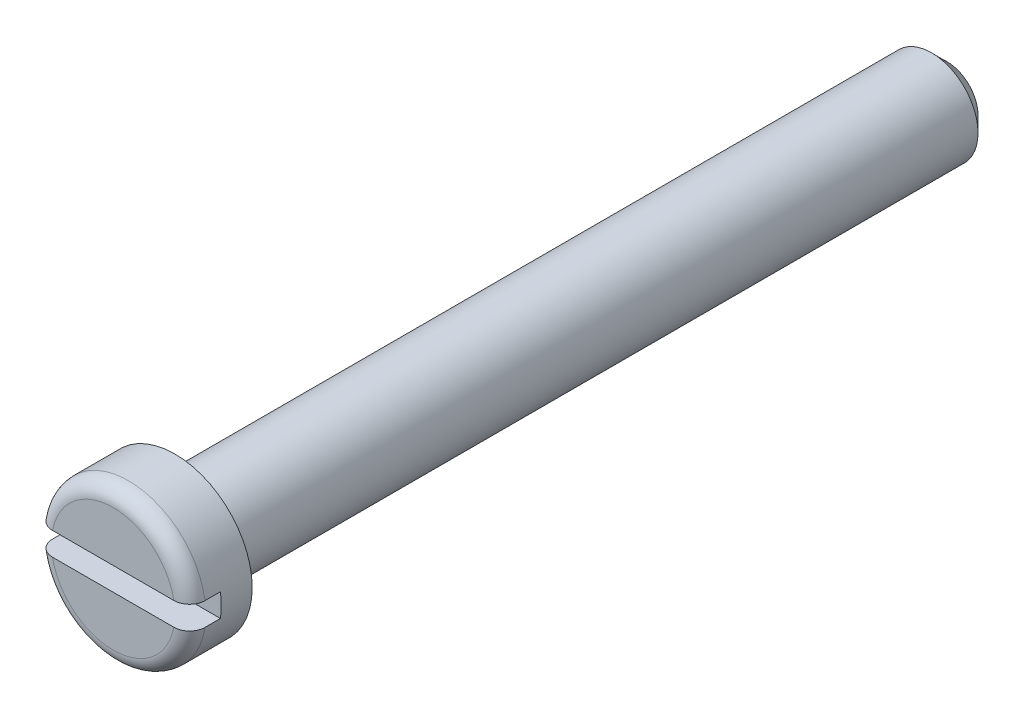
ISO-10303-21;
HEADER;
FILE_DESCRIPTION(('STEP AP214'),'2;1');
FILE_NAME('part.step','',(''),(''),'','','');
FILE_SCHEMA(('AUTOMOTIVE_DESIGN { 1 0 10303 214 1 1 1 1 }'));
ENDSEC;
DATA;
#1=APPLICATION_CONTEXT('core data for automotive mechanical design processes');
#2=APPLICATION_PROTOCOL_DEFINITION('international standard','automotive_design',2000,#1);
#3=PRODUCT_CONTEXT('',#1,'mechanical');
#4=PRODUCT('Part','Part','',(#3));
#5=PRODUCT_RELATED_PRODUCT_CATEGORY('part','',(#4));
#6=PRODUCT_DEFINITION_FORMATION('','',#4);
#7=PRODUCT_DEFINITION_CONTEXT('part definition',#1,'design');
#8=PRODUCT_DEFINITION('design','',#6,#7);
#9=PRODUCT_DEFINITION_SHAPE('','',#8);
#10=(LENGTH_UNIT() NAMED_UNIT(*) SI_UNIT(.MILLI.,.METRE.));
#11=(NAMED_UNIT(*) PLANE_ANGLE_UNIT() SI_UNIT($,.RADIAN.));
#12=(NAMED_UNIT(*) SI_UNIT($,.STERADIAN.) SOLID_ANGLE_UNIT());
#13=UNCERTAINTY_MEASURE_WITH_UNIT(LENGTH_MEASURE(1.E-05),#10,'distance_accuracy_value','');
#14=(GEOMETRIC_REPRESENTATION_CONTEXT(3) GLOBAL_UNCERTAINTY_ASSIGNED_CONTEXT((#13)) GLOBAL_UNIT_ASSIGNED_CONTEXT((#10,
#11,#12)) REPRESENTATION_CONTEXT('',''));
#15=CARTESIAN_POINT('',(0.,0.,0.));
#16=DIRECTION('',(0.,0.,1.));
#17=DIRECTION('',(1.,0.,0.));
#18=AXIS2_PLACEMENT_3D('',#15,#16,#17);
#19=CARTESIAN_POINT('',(0.,0.,54.));
#20=DIRECTION('',(0.,0.,1.));
#21=DIRECTION('',(1.,0.,0.));
#22=AXIS2_PLACEMENT_3D('',#19,#20,#21);
#23=PLANE('',#22);
#24=DIRECTION('',(-1.,0.,0.));
#25=VECTOR('',#24,1.);
#26=CARTESIAN_POINT('',(0.,0.75,54.));
#27=LINE('',#26,#25);
#28=CARTESIAN_POINT('',(3.92905841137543,0.75,54.));
#29=VERTEX_POINT('',#28);
#30=CARTESIAN_POINT('',(-3.92905841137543,0.75,54.));
#31=VERTEX_POINT('',#30);
#32=EDGE_CURVE('E131',#29,#31,#27,.T.);
#33=ORIENTED_EDGE('',*,*,#32,.F.);
#34=CARTESIAN_POINT('',(0.,0.,54.));
#35=DIRECTION('',(0.,0.,1.));
#36=DIRECTION('',(1.,0.,0.));
#37=AXIS2_PLACEMENT_3D('',#34,#35,#36);
#38=CIRCLE('',#37,4.);
#39=EDGE_CURVE('E180',#29,#31,#38,.T.);
#40=ORIENTED_EDGE('',*,*,#39,.T.);
#41=EDGE_LOOP('',(#33,#40));
#42=FACE_BOUND('',#41,.T.);
#43=ADVANCED_FACE('F31',(#42),#23,.T.);
#44=CARTESIAN_POINT('',(0.,0.,50.));
#45=DIRECTION('',(0.,0.,-1.));
#46=DIRECTION('',(-1.,0.,0.));
#47=AXIS2_PLACEMENT_3D('',#44,#45,#46);
#48=CYLINDRICAL_SURFACE('',#47,3.);
#49=CARTESIAN_POINT('',(0.,0.,1.00000000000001));
#50=DIRECTION('',(0.,0.,1.));
#51=DIRECTION('',(1.,0.,0.));
#52=AXIS2_PLACEMENT_3D('',#49,#50,#51);
#53=CIRCLE('',#52,3.);
#54=CARTESIAN_POINT('',(3.,0.,1.00000000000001));
#55=VERTEX_POINT('',#54);
#56=EDGE_CURVE('E39',#55,#55,#53,.T.);
#57=ORIENTED_EDGE('',*,*,#56,.T.);
#58=EDGE_LOOP('',(#57));
#59=FACE_BOUND('',#58,.T.);
#60=CARTESIAN_POINT('',(0.,0.,50.));
#61=DIRECTION('',(0.,0.,1.));
#62=DIRECTION('',(1.,0.,0.));
#63=AXIS2_PLACEMENT_3D('',#60,#61,#62);
#64=CIRCLE('',#63,3.);
#65=CARTESIAN_POINT('',(3.,0.,50.));
#66=VERTEX_POINT('',#65);
#67=EDGE_CURVE('E126',#66,#66,#64,.T.);
#68=ORIENTED_EDGE('',*,*,#67,.F.);
#69=EDGE_LOOP('',(#68));
#70=FACE_BOUND('',#69,.T.);
#71=ADVANCED_FACE('F33',(#59,#70),#48,.T.);
#72=CARTESIAN_POINT('',(0.,0.,0.));
#73=DIRECTION('',(0.,0.,1.));
#74=DIRECTION('',(1.,0.,0.));
#75=AXIS2_PLACEMENT_3D('',#72,#73,#74);
#76=PLANE('',#75);
#77=CARTESIAN_POINT('',(0.,0.,0.));
#78=DIRECTION('',(0.,0.,1.));
#79=DIRECTION('',(1.,0.,0.));
#80=AXIS2_PLACEMENT_3D('',#77,#78,#79);
#81=CIRCLE('',#80,1.99999999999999);
#82=CARTESIAN_POINT('',(1.99999999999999,0.,0.));
#83=VERTEX_POINT('',#82);
#84=EDGE_CURVE('E11',#83,#83,#81,.F.);
#85=ORIENTED_EDGE('',*,*,#84,.T.);
#86=EDGE_LOOP('',(#85));
#87=FACE_BOUND('',#86,.T.);
#88=ADVANCED_FACE('F161',(#87),#76,.F.);
#89=CARTESIAN_POINT('',(0.,0.,50.));
#90=DIRECTION('',(0.,0.,1.));
#91=DIRECTION('',(1.,0.,0.));
#92=AXIS2_PLACEMENT_3D('',#89,#90,#91);
#93=PLANE('',#92);
#94=CARTESIAN_POINT('',(0.,0.,50.));
#95=DIRECTION('',(0.,0.,1.));
#96=DIRECTION('',(1.,0.,0.));
#97=AXIS2_PLACEMENT_3D('',#94,#95,#96);
#98=CIRCLE('',#97,5.);
#99=CARTESIAN_POINT('',(5.,0.,50.));
#100=VERTEX_POINT('',#99);
#101=EDGE_CURVE('E123',#100,#100,#98,.T.);
#102=ORIENTED_EDGE('',*,*,#101,.F.);
#103=EDGE_LOOP('',(#102));
#104=FACE_BOUND('',#103,.T.);
#105=ORIENTED_EDGE('',*,*,#67,.T.);
#106=EDGE_LOOP('',(#105));
#107=FACE_BOUND('',#106,.T.);
#108=ADVANCED_FACE('F157',(#104,#107),#93,.F.);
#109=CARTESIAN_POINT('',(0.,0.,54.));
#110=DIRECTION('',(0.,0.,-1.));
#111=DIRECTION('',(-1.,0.,0.));
#112=AXIS2_PLACEMENT_3D('',#109,#110,#111);
#113=CYLINDRICAL_SURFACE('',#112,5.);
#114=DIRECTION('',(0.,0.,-1.));
#115=VECTOR('',#114,1.);
#116=CARTESIAN_POINT('',(4.9434299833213,-0.75,54.));
#117=LINE('',#116,#115);
#118=CARTESIAN_POINT('',(4.9434299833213,-0.75,52.));
#119=VERTEX_POINT('',#118);
#120=CARTESIAN_POINT('',(4.9434299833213,-0.75,53.));
#121=VERTEX_POINT('',#120);
#122=EDGE_CURVE('E100',#119,#121,#117,.F.);
#123=ORIENTED_EDGE('',*,*,#122,.T.);
#124=CARTESIAN_POINT('',(0.,0.,53.));
#125=DIRECTION('',(0.,0.,1.));
#126=DIRECTION('',(1.,0.,0.));
#127=AXIS2_PLACEMENT_3D('',#124,#125,#126);
#128=CIRCLE('',#127,5.);
#129=CARTESIAN_POINT('',(-4.9434299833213,-0.75,53.));
#130=VERTEX_POINT('',#129);
#131=EDGE_CURVE('E95',#121,#130,#128,.F.);
#132=ORIENTED_EDGE('',*,*,#131,.T.);
#133=DIRECTION('',(0.,0.,-1.));
#134=VECTOR('',#133,1.);
#135=CARTESIAN_POINT('',(-4.9434299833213,-0.75,54.));
#136=LINE('',#135,#134);
#137=CARTESIAN_POINT('',(-4.9434299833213,-0.75,52.));
#138=VERTEX_POINT('',#137);
#139=EDGE_CURVE('E87',#130,#138,#136,.T.);
#140=ORIENTED_EDGE('',*,*,#139,.T.);
#141=CARTESIAN_POINT('',(0.,0.,52.));
#142=DIRECTION('',(0.,0.,1.));
#143=DIRECTION('',(1.,0.,0.));
#144=AXIS2_PLACEMENT_3D('',#141,#142,#143);
#145=CIRCLE('',#144,5.);
#146=CARTESIAN_POINT('',(-4.9434299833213,0.75,52.));
#147=VERTEX_POINT('',#146);
#148=EDGE_CURVE('E93',#147,#138,#145,.T.);
#149=ORIENTED_EDGE('',*,*,#148,.F.);
#150=DIRECTION('',(0.,0.,-1.));
#151=VECTOR('',#150,1.);
#152=CARTESIAN_POINT('',(-4.9434299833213,0.75,54.));
#153=LINE('',#152,#151);
#154=CARTESIAN_POINT('',(-4.9434299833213,0.75,53.));
#155=VERTEX_POINT('',#154);
#156=EDGE_CURVE('E99',#147,#155,#153,.F.);
#157=ORIENTED_EDGE('',*,*,#156,.T.);
#158=CARTESIAN_POINT('',(0.,0.,53.));
#159=DIRECTION('',(0.,0.,1.));
#160=DIRECTION('',(1.,0.,0.));
#161=AXIS2_PLACEMENT_3D('',#158,#159,#160);
#162=CIRCLE('',#161,5.);
#163=CARTESIAN_POINT('',(4.9434299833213,0.75,53.));
#164=VERTEX_POINT('',#163);
#165=EDGE_CURVE('E184',#155,#164,#162,.F.);
#166=ORIENTED_EDGE('',*,*,#165,.T.);
#167=DIRECTION('',(0.,0.,-1.));
#168=VECTOR('',#167,1.);
#169=CARTESIAN_POINT('',(4.9434299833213,0.75,54.));
#170=LINE('',#169,#168);
#171=CARTESIAN_POINT('',(4.9434299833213,0.75,52.));
#172=VERTEX_POINT('',#171);
#173=EDGE_CURVE('E121',#164,#172,#170,.T.);
#174=ORIENTED_EDGE('',*,*,#173,.T.);
#175=EDGE_CURVE('E112',#119,#172,#145,.T.);
#176=ORIENTED_EDGE('',*,*,#175,.F.);
#177=EDGE_LOOP('',(#123,#132,#140,#149,#157,#166,#174,#176));
#178=FACE_BOUND('',#177,.T.);
#179=ORIENTED_EDGE('',*,*,#101,.T.);
#180=EDGE_LOOP('',(#179));
#181=FACE_BOUND('',#180,.T.);
#182=ADVANCED_FACE('F90',(#178,#181),#113,.T.);
#183=DIRECTION('',(1.,0.,0.));
#184=VECTOR('',#183,1.);
#185=CARTESIAN_POINT('',(0.,-0.75,54.));
#186=LINE('',#185,#184);
#187=CARTESIAN_POINT('',(-3.92905841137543,-0.75,54.));
#188=VERTEX_POINT('',#187);
#189=CARTESIAN_POINT('',(3.92905841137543,-0.75,54.));
#190=VERTEX_POINT('',#189);
#191=EDGE_CURVE('E129',#188,#190,#186,.T.);
#192=ORIENTED_EDGE('',*,*,#191,.F.);
#193=CARTESIAN_POINT('',(0.,0.,54.));
#194=DIRECTION('',(0.,0.,1.));
#195=DIRECTION('',(1.,0.,0.));
#196=AXIS2_PLACEMENT_3D('',#193,#194,#195);
#197=CIRCLE('',#196,4.);
#198=EDGE_CURVE('E111',#188,#190,#197,.T.);
#199=ORIENTED_EDGE('',*,*,#198,.T.);
#200=EDGE_LOOP('',(#192,#199));
#201=FACE_BOUND('',#200,.T.);
#202=ADVANCED_FACE('F163',(#201),#23,.T.);
#203=CARTESIAN_POINT('',(-5.69039913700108,-0.75,52.));
#204=DIRECTION('',(0.,0.,1.));
#205=DIRECTION('',(1.,0.,0.));
#206=AXIS2_PLACEMENT_3D('',#203,#204,#205);
#207=PLANE('',#206);
#208=ORIENTED_EDGE('',*,*,#148,.T.);
#209=DIRECTION('',(1.,0.,0.));
#210=VECTOR('',#209,1.);
#211=CARTESIAN_POINT('',(-5.69039913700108,-0.75,52.));
#212=LINE('',#211,#210);
#213=EDGE_CURVE('E107',#138,#119,#212,.T.);
#214=ORIENTED_EDGE('',*,*,#213,.T.);
#215=ORIENTED_EDGE('',*,*,#175,.T.);
#216=DIRECTION('',(-1.,0.,0.));
#217=VECTOR('',#216,1.);
#218=CARTESIAN_POINT('',(-5.69039913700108,0.75,52.));
#219=LINE('',#218,#217);
#220=EDGE_CURVE('E110',#172,#147,#219,.T.);
#221=ORIENTED_EDGE('',*,*,#220,.T.);
#222=EDGE_LOOP('',(#208,#214,#215,#221));
#223=FACE_BOUND('',#222,.T.);
#224=ADVANCED_FACE('F105',(#223),#207,.T.);
#225=CARTESIAN_POINT('',(-5.69039913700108,0.75,52.));
#226=DIRECTION('',(0.,1.,0.));
#227=DIRECTION('',(0.,0.,1.));
#228=AXIS2_PLACEMENT_3D('',#225,#226,#227);
#229=PLANE('',#228);
#230=ORIENTED_EDGE('',*,*,#32,.T.);
#231=CARTESIAN_POINT('',(-3.92905841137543,0.75,54.));
#232=CARTESIAN_POINT('',(-3.9579374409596,0.75,53.9999996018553));
#233=CARTESIAN_POINT('',(-3.9868031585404,0.75,53.9987922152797));
#234=CARTESIAN_POINT('',(-4.04433298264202,0.75,53.9939683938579));
#235=CARTESIAN_POINT('',(-4.07299708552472,0.75,53.990351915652));
#236=CARTESIAN_POINT('',(-4.15836171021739,0.75,53.9759066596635));
#237=CARTESIAN_POINT('',(-4.21449737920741,0.75,53.9614820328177));
#238=CARTESIAN_POINT('',(-4.32355636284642,0.75,53.92337495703));
#239=CARTESIAN_POINT('',(-4.37647706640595,0.75,53.8996850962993));
#240=CARTESIAN_POINT('',(-4.47752041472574,0.75,53.8436698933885));
#241=CARTESIAN_POINT('',(-4.52564486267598,0.75,53.8113478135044));
#242=CARTESIAN_POINT('',(-4.61518833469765,0.75,53.7393309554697));
#243=CARTESIAN_POINT('',(-4.65667217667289,0.75,53.6997167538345));
#244=CARTESIAN_POINT('',(-4.73229879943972,0.75,53.6139891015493));
#245=CARTESIAN_POINT('',(-4.76644022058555,0.75,53.5678744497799));
#246=CARTESIAN_POINT('',(-4.82592085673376,0.75,53.4711378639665));
#247=CARTESIAN_POINT('',(-4.85137165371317,0.75,53.4205844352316));
#248=CARTESIAN_POINT('',(-4.89331370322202,0.75,53.3159069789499));
#249=CARTESIAN_POINT('',(-4.90981179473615,0.75,53.2617857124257));
#250=CARTESIAN_POINT('',(-4.92884830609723,0.75,53.1727242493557));
#251=CARTESIAN_POINT('',(-4.93431353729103,0.75,53.1383825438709));
#252=CARTESIAN_POINT('',(-4.94160338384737,0.75,53.0693657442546));
#253=CARTESIAN_POINT('',(-4.94343330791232,0.75,53.0346912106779));
#254=CARTESIAN_POINT('',(-4.9434299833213,0.75,53.));
#255=B_SPLINE_CURVE_WITH_KNOTS('',3,(#231,#232,#233,#234,#235,#236,#237,#238,#239,#240,#241,
#242,#243,#244,#245,#246,#247,#248,#249,#250,#251,#252,#253,#254),.UNSPECIFIED.,.F.,.F.,(4,2,2,
2,2,2,2,2,2,2,2,4),(0.,0.0865850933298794,0.173171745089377,0.34615892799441,0.519284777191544,
0.692345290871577,0.863597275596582,1.03488094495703,1.20387456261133,1.37273890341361,
1.47688391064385,1.58087672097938),.UNSPECIFIED.);
#256=EDGE_CURVE('E46',#31,#155,#255,.T.);
#257=ORIENTED_EDGE('',*,*,#256,.T.);
#258=ORIENTED_EDGE('',*,*,#156,.F.);
#259=ORIENTED_EDGE('',*,*,#220,.F.);
#260=ORIENTED_EDGE('',*,*,#173,.F.);
#261=CARTESIAN_POINT('',(4.9434299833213,0.75,53.));
#262=CARTESIAN_POINT('',(4.94342993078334,0.75,53.0278892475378));
#263=CARTESIAN_POINT('',(4.94224916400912,0.75,53.0557650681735));
#264=CARTESIAN_POINT('',(4.93753952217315,0.75,53.1113157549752));
#265=CARTESIAN_POINT('',(4.93401080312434,0.75,53.1389906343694));
#266=CARTESIAN_POINT('',(4.91994054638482,0.75,53.2213524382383));
#267=CARTESIAN_POINT('',(4.90591478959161,0.75,53.2754852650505));
#268=CARTESIAN_POINT('',(4.86898224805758,0.75,53.380622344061));
#269=CARTESIAN_POINT('',(4.8460720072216,0.75,53.4316253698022));
#270=CARTESIAN_POINT('',(4.79205064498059,0.75,53.5290847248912));
#271=CARTESIAN_POINT('',(4.76094033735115,0.75,53.5755415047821));
#272=CARTESIAN_POINT('',(4.69127910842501,0.75,53.6628173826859));
#273=CARTESIAN_POINT('',(4.65269680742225,0.75,53.7036114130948));
#274=CARTESIAN_POINT('',(4.56928961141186,0.75,53.7782335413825));
#275=CARTESIAN_POINT('',(4.52446353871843,0.75,53.8120603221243));
#276=CARTESIAN_POINT('',(4.42933099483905,0.75,53.8721863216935));
#277=CARTESIAN_POINT('',(4.378969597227,0.75,53.8983985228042));
#278=CARTESIAN_POINT('',(4.27460791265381,0.75,53.942119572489));
#279=CARTESIAN_POINT('',(4.22060881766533,0.75,53.9596312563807));
#280=CARTESIAN_POINT('',(4.12681781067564,0.75,53.9817049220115));
#281=CARTESIAN_POINT('',(4.0875499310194,0.75,53.9885654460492));
#282=CARTESIAN_POINT('',(4.0085449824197,0.75,53.9977127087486));
#283=CARTESIAN_POINT('',(3.96880871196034,0.75,54.0000063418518));
#284=CARTESIAN_POINT('',(3.92905841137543,0.75,54.));
#285=B_SPLINE_CURVE_WITH_KNOTS('',3,(#261,#262,#263,#264,#265,#266,#267,#268,#269,#270,#271,
#272,#273,#274,#275,#276,#277,#278,#279,#280,#281,#282,#283,#284),.UNSPECIFIED.,.F.,.F.,(4,2,2,
2,2,2,2,2,2,2,2,4),(0.,0.0836161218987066,0.167226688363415,0.334125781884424,0.501089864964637,
0.668037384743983,0.835701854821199,1.0033979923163,1.17294125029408,1.34242922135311,
1.46176618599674,1.58092285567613),.UNSPECIFIED.);
#286=EDGE_CURVE('E54',#164,#29,#285,.T.);
#287=ORIENTED_EDGE('',*,*,#286,.T.);
#288=EDGE_LOOP('',(#230,#257,#258,#259,#260,#287));
#289=FACE_BOUND('',#288,.T.);
#290=ADVANCED_FACE('F155',(#289),#229,.F.);
#291=CARTESIAN_POINT('',(-5.69039913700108,-0.75,52.));
#292=DIRECTION('',(0.,-1.,0.));
#293=DIRECTION('',(0.,0.,-1.));
#294=AXIS2_PLACEMENT_3D('',#291,#292,#293);
#295=PLANE('',#294);
#296=ORIENTED_EDGE('',*,*,#191,.T.);
#297=CARTESIAN_POINT('',(3.92905841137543,-0.75,54.));
#298=CARTESIAN_POINT('',(3.9579374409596,-0.75,53.9999996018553));
#299=CARTESIAN_POINT('',(3.9868031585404,-0.75,53.9987922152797));
#300=CARTESIAN_POINT('',(4.04433298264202,-0.75,53.9939683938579));
#301=CARTESIAN_POINT('',(4.07299708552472,-0.75,53.990351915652));
#302=CARTESIAN_POINT('',(4.15836171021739,-0.75,53.9759066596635));
#303=CARTESIAN_POINT('',(4.21449737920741,-0.75,53.9614820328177));
#304=CARTESIAN_POINT('',(4.32355636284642,-0.75,53.92337495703));
#305=CARTESIAN_POINT('',(4.37647706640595,-0.75,53.8996850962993));
#306=CARTESIAN_POINT('',(4.47752041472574,-0.75,53.8436698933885));
#307=CARTESIAN_POINT('',(4.52564486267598,-0.75,53.8113478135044));
#308=CARTESIAN_POINT('',(4.61518833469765,-0.75,53.7393309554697));
#309=CARTESIAN_POINT('',(4.65667217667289,-0.75,53.6997167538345));
#310=CARTESIAN_POINT('',(4.73229879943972,-0.75,53.6139891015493));
#311=CARTESIAN_POINT('',(4.76644022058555,-0.75,53.5678744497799));
#312=CARTESIAN_POINT('',(4.82592085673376,-0.75,53.4711378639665));
#313=CARTESIAN_POINT('',(4.85137165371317,-0.75,53.4205844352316));
#314=CARTESIAN_POINT('',(4.89331370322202,-0.75,53.3159069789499));
#315=CARTESIAN_POINT('',(4.90981179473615,-0.75,53.2617857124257));
#316=CARTESIAN_POINT('',(4.92884830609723,-0.75,53.1727242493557));
#317=CARTESIAN_POINT('',(4.93431353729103,-0.75,53.1383825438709));
#318=CARTESIAN_POINT('',(4.94160338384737,-0.75,53.0693657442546));
#319=CARTESIAN_POINT('',(4.94343330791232,-0.75,53.0346912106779));
#320=CARTESIAN_POINT('',(4.9434299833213,-0.75,53.));
#321=B_SPLINE_CURVE_WITH_KNOTS('',3,(#297,#298,#299,#300,#301,#302,#303,#304,#305,#306,#307,
#308,#309,#310,#311,#312,#313,#314,#315,#316,#317,#318,#319,#320),.UNSPECIFIED.,.F.,.F.,(4,2,2,
2,2,2,2,2,2,2,2,4),(0.,0.0865850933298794,0.173171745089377,0.34615892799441,0.519284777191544,
0.692345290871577,0.863597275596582,1.03488094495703,1.20387456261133,1.37273890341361,
1.47688391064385,1.58087672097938),.UNSPECIFIED.);
#322=EDGE_CURVE('E142',#190,#121,#321,.T.);
#323=ORIENTED_EDGE('',*,*,#322,.T.);
#324=ORIENTED_EDGE('',*,*,#122,.F.);
#325=ORIENTED_EDGE('',*,*,#213,.F.);
#326=ORIENTED_EDGE('',*,*,#139,.F.);
#327=CARTESIAN_POINT('',(-4.9434299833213,-0.75,53.));
#328=CARTESIAN_POINT('',(-4.94342993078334,-0.75,53.0278892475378));
#329=CARTESIAN_POINT('',(-4.94224916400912,-0.75,53.0557650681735));
#330=CARTESIAN_POINT('',(-4.93753952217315,-0.75,53.1113157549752));
#331=CARTESIAN_POINT('',(-4.93401080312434,-0.75,53.1389906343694));
#332=CARTESIAN_POINT('',(-4.91994054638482,-0.75,53.2213524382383));
#333=CARTESIAN_POINT('',(-4.90591478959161,-0.75,53.2754852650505));
#334=CARTESIAN_POINT('',(-4.86898224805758,-0.75,53.380622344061));
#335=CARTESIAN_POINT('',(-4.8460720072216,-0.75,53.4316253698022));
#336=CARTESIAN_POINT('',(-4.79205064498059,-0.75,53.5290847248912));
#337=CARTESIAN_POINT('',(-4.76094033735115,-0.75,53.5755415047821));
#338=CARTESIAN_POINT('',(-4.69127910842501,-0.75,53.6628173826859));
#339=CARTESIAN_POINT('',(-4.65269680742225,-0.75,53.7036114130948));
#340=CARTESIAN_POINT('',(-4.56928961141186,-0.75,53.7782335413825));
#341=CARTESIAN_POINT('',(-4.52446353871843,-0.75,53.8120603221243));
#342=CARTESIAN_POINT('',(-4.42933099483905,-0.75,53.8721863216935));
#343=CARTESIAN_POINT('',(-4.378969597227,-0.75,53.8983985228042));
#344=CARTESIAN_POINT('',(-4.27460791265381,-0.75,53.942119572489));
#345=CARTESIAN_POINT('',(-4.22060881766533,-0.75,53.9596312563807));
#346=CARTESIAN_POINT('',(-4.12681781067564,-0.75,53.9817049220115));
#347=CARTESIAN_POINT('',(-4.0875499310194,-0.75,53.9885654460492));
#348=CARTESIAN_POINT('',(-4.0085449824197,-0.75,53.9977127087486));
#349=CARTESIAN_POINT('',(-3.96880871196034,-0.75,54.0000063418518));
#350=CARTESIAN_POINT('',(-3.92905841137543,-0.75,54.));
#351=B_SPLINE_CURVE_WITH_KNOTS('',3,(#327,#328,#329,#330,#331,#332,#333,#334,#335,#336,#337,
#338,#339,#340,#341,#342,#343,#344,#345,#346,#347,#348,#349,#350),.UNSPECIFIED.,.F.,.F.,(4,2,2,
2,2,2,2,2,2,2,2,4),(0.,0.0836161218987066,0.167226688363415,0.334125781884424,0.501089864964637,
0.668037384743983,0.835701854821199,1.0033979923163,1.17294125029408,1.34242922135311,
1.46176618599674,1.58092285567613),.UNSPECIFIED.);
#352=EDGE_CURVE('E135',#130,#188,#351,.T.);
#353=ORIENTED_EDGE('',*,*,#352,.T.);
#354=EDGE_LOOP('',(#296,#323,#324,#325,#326,#353));
#355=FACE_BOUND('',#354,.T.);
#356=ADVANCED_FACE('F115',(#355),#295,.F.);
#357=CARTESIAN_POINT('',(0.,0.,53.));
#358=DIRECTION('',(0.,0.,1.));
#359=DIRECTION('',(1.,0.,0.));
#360=AXIS2_PLACEMENT_3D('',#357,#358,#359);
#361=TOROIDAL_SURFACE('',#360,4.,1.);
#362=ORIENTED_EDGE('',*,*,#352,.F.);
#363=ORIENTED_EDGE('',*,*,#131,.F.);
#364=ORIENTED_EDGE('',*,*,#322,.F.);
#365=ORIENTED_EDGE('',*,*,#198,.F.);
#366=EDGE_LOOP('',(#362,#363,#364,#365));
#367=FACE_BOUND('',#366,.T.);
#368=ADVANCED_FACE('F147',(#367),#361,.T.);
#369=CARTESIAN_POINT('',(0.,0.,53.));
#370=DIRECTION('',(0.,0.,1.));
#371=DIRECTION('',(1.,0.,0.));
#372=AXIS2_PLACEMENT_3D('',#369,#370,#371);
#373=TOROIDAL_SURFACE('',#372,4.,1.);
#374=ORIENTED_EDGE('',*,*,#286,.F.);
#375=ORIENTED_EDGE('',*,*,#165,.F.);
#376=ORIENTED_EDGE('',*,*,#256,.F.);
#377=ORIENTED_EDGE('',*,*,#39,.F.);
#378=EDGE_LOOP('',(#374,#375,#376,#377));
#379=FACE_BOUND('',#378,.T.);
#380=ADVANCED_FACE('F181',(#379),#373,.T.);
#381=CARTESIAN_POINT('',(0.,0.,1.00000000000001));
#382=DIRECTION('',(0.,0.,1.));
#383=DIRECTION('',(1.,0.,0.));
#384=AXIS2_PLACEMENT_3D('',#381,#382,#383);
#385=CONICAL_SURFACE('',#384,3.,0.785398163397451);
#386=ORIENTED_EDGE('',*,*,#84,.F.);
#387=EDGE_LOOP('',(#386));
#388=FACE_BOUND('',#387,.T.);
#389=ORIENTED_EDGE('',*,*,#56,.F.);
#390=EDGE_LOOP('',(#389));
#391=FACE_BOUND('',#390,.T.);
#392=ADVANCED_FACE('F196',(#388,#391),#385,.T.);
#393=CLOSED_SHELL('',(#43,#71,#88,#108,#182,#202,#224,#290,#356,#368,#380,#392));
#394=MANIFOLD_SOLID_BREP('B2',#393);
#395=ADVANCED_BREP_SHAPE_REPRESENTATION('',(#18,#394),#14);
#396=SHAPE_DEFINITION_REPRESENTATION(#9,#395);
ENDSEC;
END-ISO-10303-21;
